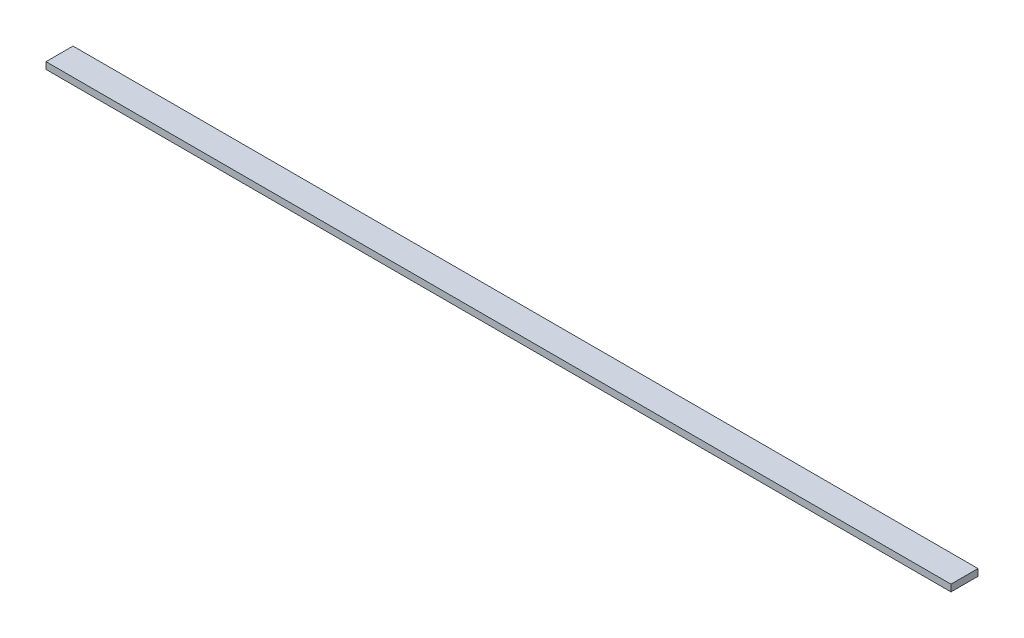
ISO-10303-21;
HEADER;
FILE_DESCRIPTION(('STEP AP214'),'2;1');
FILE_NAME('part.step','',(''),(''),'','','');
FILE_SCHEMA(('AUTOMOTIVE_DESIGN { 1 0 10303 214 1 1 1 1 }'));
ENDSEC;
DATA;
#1=APPLICATION_CONTEXT('core data for automotive mechanical design processes');
#2=APPLICATION_PROTOCOL_DEFINITION('international standard','automotive_design',2000,#1);
#3=PRODUCT_CONTEXT('',#1,'mechanical');
#4=PRODUCT('Part','Part','',(#3));
#5=PRODUCT_RELATED_PRODUCT_CATEGORY('part','',(#4));
#6=PRODUCT_DEFINITION_FORMATION('','',#4);
#7=PRODUCT_DEFINITION_CONTEXT('part definition',#1,'design');
#8=PRODUCT_DEFINITION('design','',#6,#7);
#9=PRODUCT_DEFINITION_SHAPE('','',#8);
#10=(LENGTH_UNIT() NAMED_UNIT(*) SI_UNIT(.MILLI.,.METRE.));
#11=(NAMED_UNIT(*) PLANE_ANGLE_UNIT() SI_UNIT($,.RADIAN.));
#12=(NAMED_UNIT(*) SI_UNIT($,.STERADIAN.) SOLID_ANGLE_UNIT());
#13=UNCERTAINTY_MEASURE_WITH_UNIT(LENGTH_MEASURE(1.E-05),#10,'distance_accuracy_value','');
#14=(GEOMETRIC_REPRESENTATION_CONTEXT(3) GLOBAL_UNCERTAINTY_ASSIGNED_CONTEXT((#13)) GLOBAL_UNIT_ASSIGNED_CONTEXT((#10,
#11,#12)) REPRESENTATION_CONTEXT('',''));
#15=CARTESIAN_POINT('',(0.,0.,0.));
#16=DIRECTION('',(0.,0.,1.));
#17=DIRECTION('',(1.,0.,0.));
#18=AXIS2_PLACEMENT_3D('',#15,#16,#17);
#19=CARTESIAN_POINT('',(425.45,6.35,12.7));
#20=DIRECTION('',(-1.,0.,0.));
#21=DIRECTION('',(0.,0.,1.));
#22=AXIS2_PLACEMENT_3D('',#19,#20,#21);
#23=PLANE('',#22);
#24=DIRECTION('',(0.,0.,-1.));
#25=VECTOR('',#24,1.);
#26=CARTESIAN_POINT('',(425.45,0.,12.7));
#27=LINE('',#26,#25);
#28=CARTESIAN_POINT('',(425.45,0.,12.7));
#29=VERTEX_POINT('',#28);
#30=CARTESIAN_POINT('',(425.45,0.,-12.7));
#31=VERTEX_POINT('',#30);
#32=EDGE_CURVE('E98',#29,#31,#27,.T.);
#33=ORIENTED_EDGE('',*,*,#32,.T.);
#34=DIRECTION('',(0.,-1.,0.));
#35=VECTOR('',#34,1.);
#36=CARTESIAN_POINT('',(425.45,6.35,-12.7));
#37=LINE('',#36,#35);
#38=CARTESIAN_POINT('',(425.45,6.35,-12.7));
#39=VERTEX_POINT('',#38);
#40=EDGE_CURVE('E11',#39,#31,#37,.T.);
#41=ORIENTED_EDGE('',*,*,#40,.F.);
#42=DIRECTION('',(0.,0.,-1.));
#43=VECTOR('',#42,1.);
#44=CARTESIAN_POINT('',(425.45,6.35,12.7));
#45=LINE('',#44,#43);
#46=CARTESIAN_POINT('',(425.45,6.35,12.7));
#47=VERTEX_POINT('',#46);
#48=EDGE_CURVE('E86',#47,#39,#45,.T.);
#49=ORIENTED_EDGE('',*,*,#48,.F.);
#50=DIRECTION('',(0.,-1.,0.));
#51=VECTOR('',#50,1.);
#52=CARTESIAN_POINT('',(425.45,6.35,12.7));
#53=LINE('',#52,#51);
#54=EDGE_CURVE('E94',#47,#29,#53,.T.);
#55=ORIENTED_EDGE('',*,*,#54,.T.);
#56=EDGE_LOOP('',(#33,#41,#49,#55));
#57=FACE_BOUND('',#56,.T.);
#58=ADVANCED_FACE('F35',(#57),#23,.F.);
#59=CARTESIAN_POINT('',(-425.45,6.35,-12.7));
#60=DIRECTION('',(0.,0.,1.));
#61=DIRECTION('',(1.,0.,0.));
#62=AXIS2_PLACEMENT_3D('',#59,#60,#61);
#63=PLANE('',#62);
#64=DIRECTION('',(-1.,0.,0.));
#65=VECTOR('',#64,1.);
#66=CARTESIAN_POINT('',(-425.45,0.,-12.7));
#67=LINE('',#66,#65);
#68=CARTESIAN_POINT('',(-425.45,0.,-12.7));
#69=VERTEX_POINT('',#68);
#70=EDGE_CURVE('E90',#31,#69,#67,.T.);
#71=ORIENTED_EDGE('',*,*,#70,.T.);
#72=DIRECTION('',(0.,-1.,0.));
#73=VECTOR('',#72,1.);
#74=CARTESIAN_POINT('',(-425.45,6.35,-12.7));
#75=LINE('',#74,#73);
#76=CARTESIAN_POINT('',(-425.45,6.35,-12.7));
#77=VERTEX_POINT('',#76);
#78=EDGE_CURVE('E43',#77,#69,#75,.T.);
#79=ORIENTED_EDGE('',*,*,#78,.F.);
#80=DIRECTION('',(-1.,0.,0.));
#81=VECTOR('',#80,1.);
#82=CARTESIAN_POINT('',(-425.45,6.35,-12.7));
#83=LINE('',#82,#81);
#84=EDGE_CURVE('E81',#39,#77,#83,.T.);
#85=ORIENTED_EDGE('',*,*,#84,.F.);
#86=ORIENTED_EDGE('',*,*,#40,.T.);
#87=EDGE_LOOP('',(#71,#79,#85,#86));
#88=FACE_BOUND('',#87,.T.);
#89=ADVANCED_FACE('F89',(#88),#63,.F.);
#90=CARTESIAN_POINT('',(-425.45,6.35,12.7));
#91=DIRECTION('',(1.,0.,0.));
#92=DIRECTION('',(0.,0.,-1.));
#93=AXIS2_PLACEMENT_3D('',#90,#91,#92);
#94=PLANE('',#93);
#95=DIRECTION('',(0.,0.,1.));
#96=VECTOR('',#95,1.);
#97=CARTESIAN_POINT('',(-425.45,0.,12.7));
#98=LINE('',#97,#96);
#99=CARTESIAN_POINT('',(-425.45,0.,12.7));
#100=VERTEX_POINT('',#99);
#101=EDGE_CURVE('E68',#69,#100,#98,.T.);
#102=ORIENTED_EDGE('',*,*,#101,.T.);
#103=DIRECTION('',(0.,-1.,0.));
#104=VECTOR('',#103,1.);
#105=CARTESIAN_POINT('',(-425.45,6.35,12.7));
#106=LINE('',#105,#104);
#107=CARTESIAN_POINT('',(-425.45,6.35,12.7));
#108=VERTEX_POINT('',#107);
#109=EDGE_CURVE('E91',#108,#100,#106,.T.);
#110=ORIENTED_EDGE('',*,*,#109,.F.);
#111=DIRECTION('',(0.,0.,1.));
#112=VECTOR('',#111,1.);
#113=CARTESIAN_POINT('',(-425.45,6.35,12.7));
#114=LINE('',#113,#112);
#115=EDGE_CURVE('E84',#77,#108,#114,.T.);
#116=ORIENTED_EDGE('',*,*,#115,.F.);
#117=ORIENTED_EDGE('',*,*,#78,.T.);
#118=EDGE_LOOP('',(#102,#110,#116,#117));
#119=FACE_BOUND('',#118,.T.);
#120=ADVANCED_FACE('F92',(#119),#94,.F.);
#121=CARTESIAN_POINT('',(-425.45,6.35,12.7));
#122=DIRECTION('',(0.,0.,-1.));
#123=DIRECTION('',(-1.,0.,0.));
#124=AXIS2_PLACEMENT_3D('',#121,#122,#123);
#125=PLANE('',#124);
#126=DIRECTION('',(1.,0.,0.));
#127=VECTOR('',#126,1.);
#128=CARTESIAN_POINT('',(-425.45,0.,12.7));
#129=LINE('',#128,#127);
#130=EDGE_CURVE('E74',#100,#29,#129,.T.);
#131=ORIENTED_EDGE('',*,*,#130,.T.);
#132=ORIENTED_EDGE('',*,*,#54,.F.);
#133=DIRECTION('',(1.,0.,0.));
#134=VECTOR('',#133,1.);
#135=CARTESIAN_POINT('',(-425.45,6.35,12.7));
#136=LINE('',#135,#134);
#137=EDGE_CURVE('E51',#108,#47,#136,.T.);
#138=ORIENTED_EDGE('',*,*,#137,.F.);
#139=ORIENTED_EDGE('',*,*,#109,.T.);
#140=EDGE_LOOP('',(#131,#132,#138,#139));
#141=FACE_BOUND('',#140,.T.);
#142=ADVANCED_FACE('F105',(#141),#125,.F.);
#143=CARTESIAN_POINT('',(0.,6.35,0.));
#144=DIRECTION('',(0.,-1.,0.));
#145=DIRECTION('',(0.,0.,-1.));
#146=AXIS2_PLACEMENT_3D('',#143,#144,#145);
#147=PLANE('',#146);
#148=ORIENTED_EDGE('',*,*,#48,.T.);
#149=ORIENTED_EDGE('',*,*,#84,.T.);
#150=ORIENTED_EDGE('',*,*,#115,.T.);
#151=ORIENTED_EDGE('',*,*,#137,.T.);
#152=EDGE_LOOP('',(#148,#149,#150,#151));
#153=FACE_BOUND('',#152,.T.);
#154=ADVANCED_FACE('F82',(#153),#147,.F.);
#155=CARTESIAN_POINT('',(0.,0.,0.));
#156=DIRECTION('',(0.,-1.,0.));
#157=DIRECTION('',(0.,0.,-1.));
#158=AXIS2_PLACEMENT_3D('',#155,#156,#157);
#159=PLANE('',#158);
#160=ORIENTED_EDGE('',*,*,#32,.F.);
#161=ORIENTED_EDGE('',*,*,#130,.F.);
#162=ORIENTED_EDGE('',*,*,#101,.F.);
#163=ORIENTED_EDGE('',*,*,#70,.F.);
#164=EDGE_LOOP('',(#160,#161,#162,#163));
#165=FACE_BOUND('',#164,.T.);
#166=ADVANCED_FACE('F108',(#165),#159,.T.);
#167=CLOSED_SHELL('',(#58,#89,#120,#142,#154,#166));
#168=MANIFOLD_SOLID_BREP('B2',#167);
#169=ADVANCED_BREP_SHAPE_REPRESENTATION('',(#18,#168),#14);
#170=SHAPE_DEFINITION_REPRESENTATION(#9,#169);
ENDSEC;
END-ISO-10303-21;
